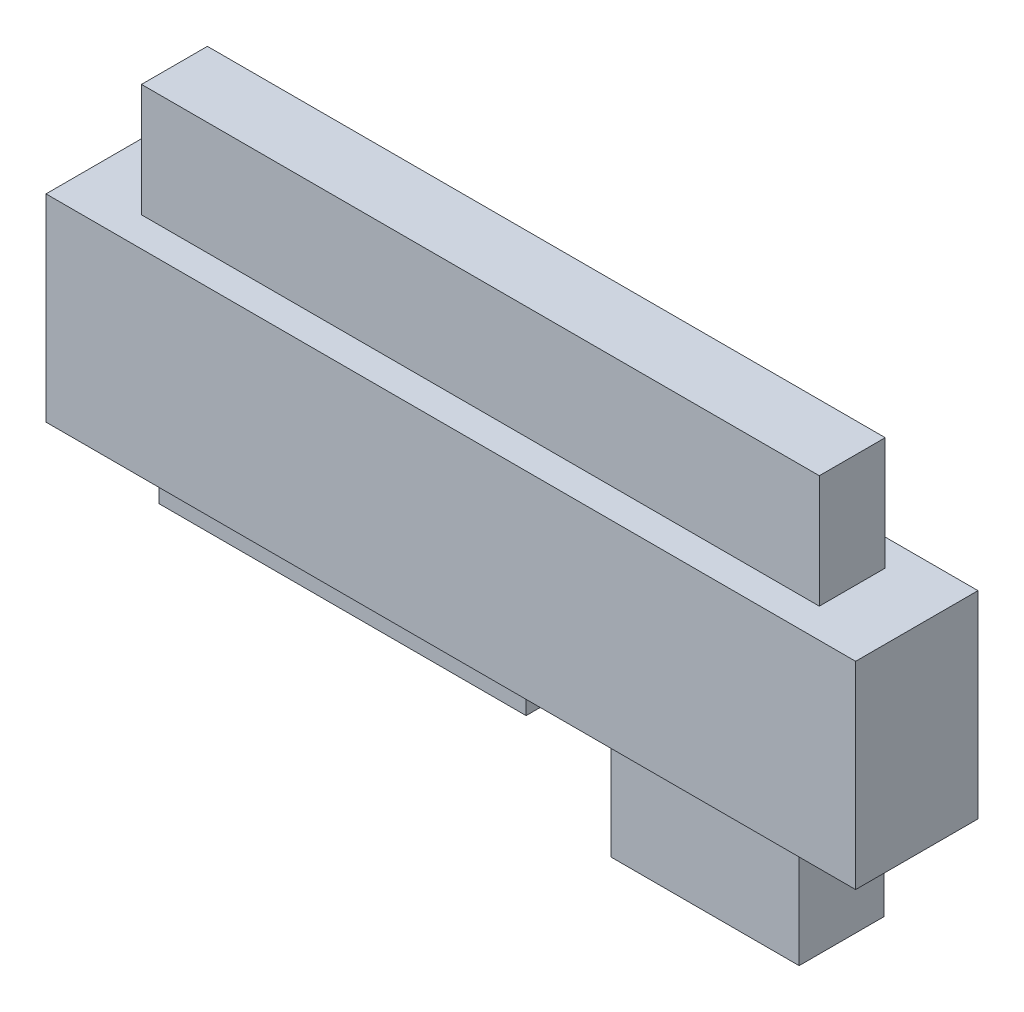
ISO-10303-21;
HEADER;
FILE_DESCRIPTION(('STEP AP214'),'2;1');
FILE_NAME('part.step','',(''),(''),'','','');
FILE_SCHEMA(('AUTOMOTIVE_DESIGN { 1 0 10303 214 1 1 1 1 }'));
ENDSEC;
DATA;
#1=APPLICATION_CONTEXT('core data for automotive mechanical design processes');
#2=APPLICATION_PROTOCOL_DEFINITION('international standard','automotive_design',2000,#1);
#3=PRODUCT_CONTEXT('',#1,'mechanical');
#4=PRODUCT('Part','Part','',(#3));
#5=PRODUCT_RELATED_PRODUCT_CATEGORY('part','',(#4));
#6=PRODUCT_DEFINITION_FORMATION('','',#4);
#7=PRODUCT_DEFINITION_CONTEXT('part definition',#1,'design');
#8=PRODUCT_DEFINITION('design','',#6,#7);
#9=PRODUCT_DEFINITION_SHAPE('','',#8);
#10=(LENGTH_UNIT() NAMED_UNIT(*) SI_UNIT(.MILLI.,.METRE.));
#11=(NAMED_UNIT(*) PLANE_ANGLE_UNIT() SI_UNIT($,.RADIAN.));
#12=(NAMED_UNIT(*) SI_UNIT($,.STERADIAN.) SOLID_ANGLE_UNIT());
#13=UNCERTAINTY_MEASURE_WITH_UNIT(LENGTH_MEASURE(1.E-05),#10,'distance_accuracy_value','');
#14=(GEOMETRIC_REPRESENTATION_CONTEXT(3) GLOBAL_UNCERTAINTY_ASSIGNED_CONTEXT((#13)) GLOBAL_UNIT_ASSIGNED_CONTEXT((#10,
#11,#12)) REPRESENTATION_CONTEXT('',''));
#15=CARTESIAN_POINT('',(0.,0.,0.));
#16=DIRECTION('',(0.,0.,1.));
#17=DIRECTION('',(1.,0.,0.));
#18=AXIS2_PLACEMENT_3D('',#15,#16,#17);
#19=CARTESIAN_POINT('',(0.,0.,0.));
#20=DIRECTION('',(0.,-1.,0.));
#21=DIRECTION('',(0.,0.,-1.));
#22=AXIS2_PLACEMENT_3D('',#19,#20,#21);
#23=PLANE('',#22);
#24=DIRECTION('',(-1.,0.,0.));
#25=VECTOR('',#24,1.);
#26=CARTESIAN_POINT('',(7.50000000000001,0.,2.25));
#27=LINE('',#26,#25);
#28=CARTESIAN_POINT('',(17.5,0.,2.25));
#29=VERTEX_POINT('',#28);
#30=CARTESIAN_POINT('',(7.50000000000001,0.,2.25));
#31=VERTEX_POINT('',#30);
#32=EDGE_CURVE('E190',#29,#31,#27,.T.);
#33=ORIENTED_EDGE('',*,*,#32,.F.);
#34=DIRECTION('',(0.,0.,1.));
#35=VECTOR('',#34,1.);
#36=CARTESIAN_POINT('',(17.5,0.,-2.25));
#37=LINE('',#36,#35);
#38=CARTESIAN_POINT('',(17.5,0.,-2.25));
#39=VERTEX_POINT('',#38);
#40=EDGE_CURVE('E169',#39,#29,#37,.T.);
#41=ORIENTED_EDGE('',*,*,#40,.F.);
#42=DIRECTION('',(1.,0.,0.));
#43=VECTOR('',#42,1.);
#44=CARTESIAN_POINT('',(7.50000000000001,0.,-2.25));
#45=LINE('',#44,#43);
#46=CARTESIAN_POINT('',(7.50000000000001,0.,-2.25));
#47=VERTEX_POINT('',#46);
#48=EDGE_CURVE('E183',#47,#39,#45,.T.);
#49=ORIENTED_EDGE('',*,*,#48,.F.);
#50=DIRECTION('',(0.,0.,-1.));
#51=VECTOR('',#50,1.);
#52=CARTESIAN_POINT('',(7.50000000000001,0.,-2.25));
#53=LINE('',#52,#51);
#54=EDGE_CURVE('E57',#31,#47,#53,.T.);
#55=ORIENTED_EDGE('',*,*,#54,.F.);
#56=EDGE_LOOP('',(#33,#41,#49,#55));
#57=FACE_BOUND('',#56,.T.);
#58=DIRECTION('',(0.,0.,-1.));
#59=VECTOR('',#58,1.);
#60=CARTESIAN_POINT('',(21.5,0.,3.25));
#61=LINE('',#60,#59);
#62=CARTESIAN_POINT('',(21.5,0.,3.25));
#63=VERTEX_POINT('',#62);
#64=CARTESIAN_POINT('',(21.5,0.,-3.25));
#65=VERTEX_POINT('',#64);
#66=EDGE_CURVE('E221',#63,#65,#61,.T.);
#67=ORIENTED_EDGE('',*,*,#66,.F.);
#68=DIRECTION('',(1.,0.,0.));
#69=VECTOR('',#68,1.);
#70=CARTESIAN_POINT('',(-21.5,0.,3.25));
#71=LINE('',#70,#69);
#72=CARTESIAN_POINT('',(-21.5,0.,3.25));
#73=VERTEX_POINT('',#72);
#74=EDGE_CURVE('E251',#73,#63,#71,.T.);
#75=ORIENTED_EDGE('',*,*,#74,.F.);
#76=DIRECTION('',(0.,0.,1.));
#77=VECTOR('',#76,1.);
#78=CARTESIAN_POINT('',(-21.5,0.,3.25));
#79=LINE('',#78,#77);
#80=CARTESIAN_POINT('',(-21.5,0.,-3.25));
#81=VERTEX_POINT('',#80);
#82=EDGE_CURVE('E262',#81,#73,#79,.T.);
#83=ORIENTED_EDGE('',*,*,#82,.F.);
#84=DIRECTION('',(-1.,0.,0.));
#85=VECTOR('',#84,1.);
#86=CARTESIAN_POINT('',(-21.5,0.,-3.25));
#87=LINE('',#86,#85);
#88=EDGE_CURVE('E260',#65,#81,#87,.T.);
#89=ORIENTED_EDGE('',*,*,#88,.F.);
#90=EDGE_LOOP('',(#67,#75,#83,#89));
#91=FACE_BOUND('',#90,.T.);
#92=DIRECTION('',(-1.,0.,0.));
#93=VECTOR('',#92,1.);
#94=CARTESIAN_POINT('',(-16.75,0.,2.));
#95=LINE('',#94,#93);
#96=CARTESIAN_POINT('',(2.75000000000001,0.,2.));
#97=VERTEX_POINT('',#96);
#98=CARTESIAN_POINT('',(-16.75,0.,2.));
#99=VERTEX_POINT('',#98);
#100=EDGE_CURVE('E179',#97,#99,#95,.T.);
#101=ORIENTED_EDGE('',*,*,#100,.F.);
#102=DIRECTION('',(0.,0.,1.));
#103=VECTOR('',#102,1.);
#104=CARTESIAN_POINT('',(2.75000000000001,0.,-2.));
#105=LINE('',#104,#103);
#106=CARTESIAN_POINT('',(2.75000000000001,0.,-2.));
#107=VERTEX_POINT('',#106);
#108=EDGE_CURVE('E173',#107,#97,#105,.T.);
#109=ORIENTED_EDGE('',*,*,#108,.F.);
#110=DIRECTION('',(1.,0.,0.));
#111=VECTOR('',#110,1.);
#112=CARTESIAN_POINT('',(-16.75,0.,-2.));
#113=LINE('',#112,#111);
#114=CARTESIAN_POINT('',(-16.75,0.,-2.));
#115=VERTEX_POINT('',#114);
#116=EDGE_CURVE('E153',#115,#107,#113,.T.);
#117=ORIENTED_EDGE('',*,*,#116,.F.);
#118=DIRECTION('',(0.,0.,-1.));
#119=VECTOR('',#118,1.);
#120=CARTESIAN_POINT('',(-16.75,0.,-2.));
#121=LINE('',#120,#119);
#122=EDGE_CURVE('E49',#99,#115,#121,.T.);
#123=ORIENTED_EDGE('',*,*,#122,.F.);
#124=EDGE_LOOP('',(#101,#109,#117,#123));
#125=FACE_BOUND('',#124,.T.);
#126=ADVANCED_FACE('F34',(#57,#91,#125),#23,.T.);
#127=CARTESIAN_POINT('',(0.,10.5,0.));
#128=DIRECTION('',(0.,-1.,0.));
#129=DIRECTION('',(0.,0.,-1.));
#130=AXIS2_PLACEMENT_3D('',#127,#128,#129);
#131=PLANE('',#130);
#132=DIRECTION('',(0.,0.,-1.));
#133=VECTOR('',#132,1.);
#134=CARTESIAN_POINT('',(21.5,10.5,3.25));
#135=LINE('',#134,#133);
#136=CARTESIAN_POINT('',(21.5,10.5,3.25));
#137=VERTEX_POINT('',#136);
#138=CARTESIAN_POINT('',(21.5,10.5,-3.25));
#139=VERTEX_POINT('',#138);
#140=EDGE_CURVE('E247',#137,#139,#135,.T.);
#141=ORIENTED_EDGE('',*,*,#140,.T.);
#142=DIRECTION('',(-1.,0.,0.));
#143=VECTOR('',#142,1.);
#144=CARTESIAN_POINT('',(-21.5,10.5,-3.25));
#145=LINE('',#144,#143);
#146=CARTESIAN_POINT('',(-21.5,10.5,-3.25));
#147=VERTEX_POINT('',#146);
#148=EDGE_CURVE('E250',#139,#147,#145,.T.);
#149=ORIENTED_EDGE('',*,*,#148,.T.);
#150=DIRECTION('',(0.,0.,1.));
#151=VECTOR('',#150,1.);
#152=CARTESIAN_POINT('',(-21.5,10.5,3.25));
#153=LINE('',#152,#151);
#154=CARTESIAN_POINT('',(-21.5,10.5,3.25));
#155=VERTEX_POINT('',#154);
#156=EDGE_CURVE('E253',#147,#155,#153,.T.);
#157=ORIENTED_EDGE('',*,*,#156,.T.);
#158=DIRECTION('',(1.,0.,0.));
#159=VECTOR('',#158,1.);
#160=CARTESIAN_POINT('',(-21.5,10.5,3.25));
#161=LINE('',#160,#159);
#162=EDGE_CURVE('E255',#155,#137,#161,.T.);
#163=ORIENTED_EDGE('',*,*,#162,.T.);
#164=EDGE_LOOP('',(#141,#149,#157,#163));
#165=FACE_BOUND('',#164,.T.);
#166=DIRECTION('',(1.,0.,0.));
#167=VECTOR('',#166,1.);
#168=CARTESIAN_POINT('',(-18.,10.5,1.67788848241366));
#169=LINE('',#168,#167);
#170=CARTESIAN_POINT('',(-18.,10.5,1.67788848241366));
#171=VERTEX_POINT('',#170);
#172=CARTESIAN_POINT('',(18.,10.5,1.67788848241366));
#173=VERTEX_POINT('',#172);
#174=EDGE_CURVE('E230',#171,#173,#169,.T.);
#175=ORIENTED_EDGE('',*,*,#174,.F.);
#176=DIRECTION('',(0.,0.,1.));
#177=VECTOR('',#176,1.);
#178=CARTESIAN_POINT('',(-18.,10.5,1.67788848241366));
#179=LINE('',#178,#177);
#180=CARTESIAN_POINT('',(-18.,10.5,-1.82211151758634));
#181=VERTEX_POINT('',#180);
#182=EDGE_CURVE('E227',#181,#171,#179,.T.);
#183=ORIENTED_EDGE('',*,*,#182,.F.);
#184=DIRECTION('',(-1.,0.,0.));
#185=VECTOR('',#184,1.);
#186=CARTESIAN_POINT('',(-18.,10.5,-1.82211151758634));
#187=LINE('',#186,#185);
#188=CARTESIAN_POINT('',(18.,10.5,-1.82211151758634));
#189=VERTEX_POINT('',#188);
#190=EDGE_CURVE('E224',#189,#181,#187,.T.);
#191=ORIENTED_EDGE('',*,*,#190,.F.);
#192=DIRECTION('',(0.,0.,-1.));
#193=VECTOR('',#192,1.);
#194=CARTESIAN_POINT('',(18.,10.5,1.67788848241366));
#195=LINE('',#194,#193);
#196=EDGE_CURVE('E199',#173,#189,#195,.T.);
#197=ORIENTED_EDGE('',*,*,#196,.F.);
#198=EDGE_LOOP('',(#175,#183,#191,#197));
#199=FACE_BOUND('',#198,.T.);
#200=ADVANCED_FACE('F289',(#165,#199),#131,.F.);
#201=CARTESIAN_POINT('',(21.5,10.5,3.25));
#202=DIRECTION('',(-1.,0.,0.));
#203=DIRECTION('',(0.,0.,1.));
#204=AXIS2_PLACEMENT_3D('',#201,#202,#203);
#205=PLANE('',#204);
#206=ORIENTED_EDGE('',*,*,#66,.T.);
#207=DIRECTION('',(0.,-1.,0.));
#208=VECTOR('',#207,1.);
#209=CARTESIAN_POINT('',(21.5,10.5,-3.25));
#210=LINE('',#209,#208);
#211=EDGE_CURVE('E12',#139,#65,#210,.T.);
#212=ORIENTED_EDGE('',*,*,#211,.F.);
#213=ORIENTED_EDGE('',*,*,#140,.F.);
#214=DIRECTION('',(0.,-1.,0.));
#215=VECTOR('',#214,1.);
#216=CARTESIAN_POINT('',(21.5,10.5,3.25));
#217=LINE('',#216,#215);
#218=EDGE_CURVE('E257',#137,#63,#217,.T.);
#219=ORIENTED_EDGE('',*,*,#218,.T.);
#220=EDGE_LOOP('',(#206,#212,#213,#219));
#221=FACE_BOUND('',#220,.T.);
#222=ADVANCED_FACE('F36',(#221),#205,.F.);
#223=CARTESIAN_POINT('',(-21.5,10.5,-3.25));
#224=DIRECTION('',(0.,0.,1.));
#225=DIRECTION('',(1.,0.,0.));
#226=AXIS2_PLACEMENT_3D('',#223,#224,#225);
#227=PLANE('',#226);
#228=ORIENTED_EDGE('',*,*,#88,.T.);
#229=DIRECTION('',(0.,-1.,0.));
#230=VECTOR('',#229,1.);
#231=CARTESIAN_POINT('',(-21.5,10.5,-3.25));
#232=LINE('',#231,#230);
#233=EDGE_CURVE('E42',#147,#81,#232,.T.);
#234=ORIENTED_EDGE('',*,*,#233,.F.);
#235=ORIENTED_EDGE('',*,*,#148,.F.);
#236=ORIENTED_EDGE('',*,*,#211,.T.);
#237=EDGE_LOOP('',(#228,#234,#235,#236));
#238=FACE_BOUND('',#237,.T.);
#239=ADVANCED_FACE('F291',(#238),#227,.F.);
#240=CARTESIAN_POINT('',(-21.5,10.5,3.25));
#241=DIRECTION('',(1.,0.,0.));
#242=DIRECTION('',(0.,0.,-1.));
#243=AXIS2_PLACEMENT_3D('',#240,#241,#242);
#244=PLANE('',#243);
#245=ORIENTED_EDGE('',*,*,#82,.T.);
#246=DIRECTION('',(0.,-1.,0.));
#247=VECTOR('',#246,1.);
#248=CARTESIAN_POINT('',(-21.5,10.5,3.25));
#249=LINE('',#248,#247);
#250=EDGE_CURVE('E267',#155,#73,#249,.T.);
#251=ORIENTED_EDGE('',*,*,#250,.F.);
#252=ORIENTED_EDGE('',*,*,#156,.F.);
#253=ORIENTED_EDGE('',*,*,#233,.T.);
#254=EDGE_LOOP('',(#245,#251,#252,#253));
#255=FACE_BOUND('',#254,.T.);
#256=ADVANCED_FACE('F274',(#255),#244,.F.);
#257=CARTESIAN_POINT('',(-21.5,10.5,3.25));
#258=DIRECTION('',(0.,0.,-1.));
#259=DIRECTION('',(-1.,0.,0.));
#260=AXIS2_PLACEMENT_3D('',#257,#258,#259);
#261=PLANE('',#260);
#262=ORIENTED_EDGE('',*,*,#74,.T.);
#263=ORIENTED_EDGE('',*,*,#218,.F.);
#264=ORIENTED_EDGE('',*,*,#162,.F.);
#265=ORIENTED_EDGE('',*,*,#250,.T.);
#266=EDGE_LOOP('',(#262,#263,#264,#265));
#267=FACE_BOUND('',#266,.T.);
#268=ADVANCED_FACE('F283',(#267),#261,.F.);
#269=CARTESIAN_POINT('',(-18.,69.1697387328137,1.67788848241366));
#270=DIRECTION('',(0.,0.,-1.));
#271=DIRECTION('',(-1.,0.,0.));
#272=AXIS2_PLACEMENT_3D('',#269,#270,#271);
#273=PLANE('',#272);
#274=DIRECTION('',(0.,-1.,0.));
#275=VECTOR('',#274,1.);
#276=CARTESIAN_POINT('',(18.,69.1697387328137,1.67788848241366));
#277=LINE('',#276,#275);
#278=CARTESIAN_POINT('',(18.,16.5,1.67788848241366));
#279=VERTEX_POINT('',#278);
#280=EDGE_CURVE('E233',#279,#173,#277,.T.);
#281=ORIENTED_EDGE('',*,*,#280,.F.);
#282=DIRECTION('',(-1.,0.,0.));
#283=VECTOR('',#282,1.);
#284=CARTESIAN_POINT('',(-18.,16.5,1.67788848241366));
#285=LINE('',#284,#283);
#286=CARTESIAN_POINT('',(-18.,16.5,1.67788848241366));
#287=VERTEX_POINT('',#286);
#288=EDGE_CURVE('E215',#279,#287,#285,.T.);
#289=ORIENTED_EDGE('',*,*,#288,.T.);
#290=DIRECTION('',(0.,-1.,0.));
#291=VECTOR('',#290,1.);
#292=CARTESIAN_POINT('',(-18.,69.1697387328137,1.67788848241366));
#293=LINE('',#292,#291);
#294=EDGE_CURVE('E236',#287,#171,#293,.T.);
#295=ORIENTED_EDGE('',*,*,#294,.T.);
#296=ORIENTED_EDGE('',*,*,#174,.T.);
#297=EDGE_LOOP('',(#281,#289,#295,#296));
#298=FACE_BOUND('',#297,.T.);
#299=ADVANCED_FACE('F309',(#298),#273,.F.);
#300=CARTESIAN_POINT('',(-18.,69.1697387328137,1.67788848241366));
#301=DIRECTION('',(1.,0.,0.));
#302=DIRECTION('',(0.,0.,-1.));
#303=AXIS2_PLACEMENT_3D('',#300,#301,#302);
#304=PLANE('',#303);
#305=ORIENTED_EDGE('',*,*,#294,.F.);
#306=DIRECTION('',(0.,0.,-1.));
#307=VECTOR('',#306,1.);
#308=CARTESIAN_POINT('',(-18.,16.5,1.67788848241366));
#309=LINE('',#308,#307);
#310=CARTESIAN_POINT('',(-18.,16.5,-1.82211151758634));
#311=VERTEX_POINT('',#310);
#312=EDGE_CURVE('E211',#287,#311,#309,.T.);
#313=ORIENTED_EDGE('',*,*,#312,.T.);
#314=DIRECTION('',(0.,-1.,0.));
#315=VECTOR('',#314,1.);
#316=CARTESIAN_POINT('',(-18.,69.1697387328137,-1.82211151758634));
#317=LINE('',#316,#315);
#318=EDGE_CURVE('E239',#311,#181,#317,.T.);
#319=ORIENTED_EDGE('',*,*,#318,.T.);
#320=ORIENTED_EDGE('',*,*,#182,.T.);
#321=EDGE_LOOP('',(#305,#313,#319,#320));
#322=FACE_BOUND('',#321,.T.);
#323=ADVANCED_FACE('F313',(#322),#304,.F.);
#324=CARTESIAN_POINT('',(-18.,69.1697387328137,-1.82211151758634));
#325=DIRECTION('',(0.,0.,1.));
#326=DIRECTION('',(1.,0.,0.));
#327=AXIS2_PLACEMENT_3D('',#324,#325,#326);
#328=PLANE('',#327);
#329=ORIENTED_EDGE('',*,*,#318,.F.);
#330=DIRECTION('',(1.,0.,0.));
#331=VECTOR('',#330,1.);
#332=CARTESIAN_POINT('',(-18.,16.5,-1.82211151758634));
#333=LINE('',#332,#331);
#334=CARTESIAN_POINT('',(18.,16.5,-1.82211151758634));
#335=VERTEX_POINT('',#334);
#336=EDGE_CURVE('E214',#311,#335,#333,.T.);
#337=ORIENTED_EDGE('',*,*,#336,.T.);
#338=DIRECTION('',(0.,-1.,0.));
#339=VECTOR('',#338,1.);
#340=CARTESIAN_POINT('',(18.,69.1697387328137,-1.82211151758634));
#341=LINE('',#340,#339);
#342=EDGE_CURVE('E242',#335,#189,#341,.T.);
#343=ORIENTED_EDGE('',*,*,#342,.T.);
#344=ORIENTED_EDGE('',*,*,#190,.T.);
#345=EDGE_LOOP('',(#329,#337,#343,#344));
#346=FACE_BOUND('',#345,.T.);
#347=ADVANCED_FACE('F319',(#346),#328,.F.);
#348=CARTESIAN_POINT('',(18.,69.1697387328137,1.67788848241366));
#349=DIRECTION('',(-1.,0.,0.));
#350=DIRECTION('',(0.,0.,1.));
#351=AXIS2_PLACEMENT_3D('',#348,#349,#350);
#352=PLANE('',#351);
#353=ORIENTED_EDGE('',*,*,#342,.F.);
#354=DIRECTION('',(0.,0.,1.));
#355=VECTOR('',#354,1.);
#356=CARTESIAN_POINT('',(18.,16.5,1.67788848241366));
#357=LINE('',#356,#355);
#358=EDGE_CURVE('E218',#335,#279,#357,.T.);
#359=ORIENTED_EDGE('',*,*,#358,.T.);
#360=ORIENTED_EDGE('',*,*,#280,.T.);
#361=ORIENTED_EDGE('',*,*,#196,.T.);
#362=EDGE_LOOP('',(#353,#359,#360,#361));
#363=FACE_BOUND('',#362,.T.);
#364=ADVANCED_FACE('F328',(#363),#352,.F.);
#365=CARTESIAN_POINT('',(0.,16.5,0.));
#366=DIRECTION('',(0.,-1.,0.));
#367=DIRECTION('',(0.,0.,-1.));
#368=AXIS2_PLACEMENT_3D('',#365,#366,#367);
#369=PLANE('',#368);
#370=ORIENTED_EDGE('',*,*,#336,.F.);
#371=ORIENTED_EDGE('',*,*,#312,.F.);
#372=ORIENTED_EDGE('',*,*,#288,.F.);
#373=ORIENTED_EDGE('',*,*,#358,.F.);
#374=EDGE_LOOP('',(#370,#371,#372,#373));
#375=FACE_BOUND('',#374,.T.);
#376=ADVANCED_FACE('F324',(#375),#369,.F.);
#377=CARTESIAN_POINT('',(17.5,-33.4658560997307,-2.25));
#378=DIRECTION('',(-1.,0.,0.));
#379=DIRECTION('',(0.,0.,1.));
#380=AXIS2_PLACEMENT_3D('',#377,#378,#379);
#381=PLANE('',#380);
#382=DIRECTION('',(0.,0.,1.));
#383=VECTOR('',#382,1.);
#384=CARTESIAN_POINT('',(17.5,-6.,-2.25));
#385=LINE('',#384,#383);
#386=CARTESIAN_POINT('',(17.5,-6.,-2.25));
#387=VERTEX_POINT('',#386);
#388=CARTESIAN_POINT('',(17.5,-6.,2.25));
#389=VERTEX_POINT('',#388);
#390=EDGE_CURVE('E203',#387,#389,#385,.T.);
#391=ORIENTED_EDGE('',*,*,#390,.F.);
#392=DIRECTION('',(0.,1.,0.));
#393=VECTOR('',#392,1.);
#394=CARTESIAN_POINT('',(17.5,-33.4658560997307,-2.25));
#395=LINE('',#394,#393);
#396=EDGE_CURVE('E167',#387,#39,#395,.T.);
#397=ORIENTED_EDGE('',*,*,#396,.T.);
#398=ORIENTED_EDGE('',*,*,#40,.T.);
#399=DIRECTION('',(0.,1.,0.));
#400=VECTOR('',#399,1.);
#401=CARTESIAN_POINT('',(17.5,-33.4658560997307,2.25));
#402=LINE('',#401,#400);
#403=EDGE_CURVE('E193',#389,#29,#402,.T.);
#404=ORIENTED_EDGE('',*,*,#403,.F.);
#405=EDGE_LOOP('',(#391,#397,#398,#404));
#406=FACE_BOUND('',#405,.T.);
#407=ADVANCED_FACE('F335',(#406),#381,.F.);
#408=CARTESIAN_POINT('',(7.50000000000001,-33.4658560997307,2.25));
#409=DIRECTION('',(0.,0.,-1.));
#410=DIRECTION('',(-1.,0.,0.));
#411=AXIS2_PLACEMENT_3D('',#408,#409,#410);
#412=PLANE('',#411);
#413=DIRECTION('',(-1.,0.,0.));
#414=VECTOR('',#413,1.);
#415=CARTESIAN_POINT('',(7.50000000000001,-6.,2.25));
#416=LINE('',#415,#414);
#417=CARTESIAN_POINT('',(7.50000000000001,-6.,2.25));
#418=VERTEX_POINT('',#417);
#419=EDGE_CURVE('E200',#389,#418,#416,.T.);
#420=ORIENTED_EDGE('',*,*,#419,.F.);
#421=ORIENTED_EDGE('',*,*,#403,.T.);
#422=ORIENTED_EDGE('',*,*,#32,.T.);
#423=DIRECTION('',(0.,1.,0.));
#424=VECTOR('',#423,1.);
#425=CARTESIAN_POINT('',(7.50000000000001,-33.4658560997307,2.25));
#426=LINE('',#425,#424);
#427=EDGE_CURVE('E189',#418,#31,#426,.T.);
#428=ORIENTED_EDGE('',*,*,#427,.F.);
#429=EDGE_LOOP('',(#420,#421,#422,#428));
#430=FACE_BOUND('',#429,.T.);
#431=ADVANCED_FACE('F343',(#430),#412,.F.);
#432=CARTESIAN_POINT('',(7.50000000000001,-33.4658560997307,-2.25));
#433=DIRECTION('',(1.,0.,0.));
#434=DIRECTION('',(0.,0.,-1.));
#435=AXIS2_PLACEMENT_3D('',#432,#433,#434);
#436=PLANE('',#435);
#437=DIRECTION('',(0.,0.,-1.));
#438=VECTOR('',#437,1.);
#439=CARTESIAN_POINT('',(7.50000000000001,-6.,-2.25));
#440=LINE('',#439,#438);
#441=CARTESIAN_POINT('',(7.50000000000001,-6.,-2.25));
#442=VERTEX_POINT('',#441);
#443=EDGE_CURVE('E196',#418,#442,#440,.T.);
#444=ORIENTED_EDGE('',*,*,#443,.F.);
#445=ORIENTED_EDGE('',*,*,#427,.T.);
#446=ORIENTED_EDGE('',*,*,#54,.T.);
#447=DIRECTION('',(0.,1.,0.));
#448=VECTOR('',#447,1.);
#449=CARTESIAN_POINT('',(7.50000000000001,-33.4658560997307,-2.25));
#450=LINE('',#449,#448);
#451=EDGE_CURVE('E187',#442,#47,#450,.T.);
#452=ORIENTED_EDGE('',*,*,#451,.F.);
#453=EDGE_LOOP('',(#444,#445,#446,#452));
#454=FACE_BOUND('',#453,.T.);
#455=ADVANCED_FACE('F349',(#454),#436,.F.);
#456=CARTESIAN_POINT('',(7.50000000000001,-33.4658560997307,-2.25));
#457=DIRECTION('',(0.,0.,1.));
#458=DIRECTION('',(1.,0.,0.));
#459=AXIS2_PLACEMENT_3D('',#456,#457,#458);
#460=PLANE('',#459);
#461=DIRECTION('',(1.,0.,0.));
#462=VECTOR('',#461,1.);
#463=CARTESIAN_POINT('',(7.50000000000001,-6.,-2.25));
#464=LINE('',#463,#462);
#465=EDGE_CURVE('E186',#442,#387,#464,.T.);
#466=ORIENTED_EDGE('',*,*,#465,.F.);
#467=ORIENTED_EDGE('',*,*,#451,.T.);
#468=ORIENTED_EDGE('',*,*,#48,.T.);
#469=ORIENTED_EDGE('',*,*,#396,.F.);
#470=EDGE_LOOP('',(#466,#467,#468,#469));
#471=FACE_BOUND('',#470,.T.);
#472=ADVANCED_FACE('F357',(#471),#460,.F.);
#473=CARTESIAN_POINT('',(0.,-6.,0.));
#474=DIRECTION('',(0.,-1.,0.));
#475=DIRECTION('',(0.,0.,-1.));
#476=AXIS2_PLACEMENT_3D('',#473,#474,#475);
#477=PLANE('',#476);
#478=ORIENTED_EDGE('',*,*,#465,.T.);
#479=ORIENTED_EDGE('',*,*,#390,.T.);
#480=ORIENTED_EDGE('',*,*,#419,.T.);
#481=ORIENTED_EDGE('',*,*,#443,.T.);
#482=EDGE_LOOP('',(#478,#479,#480,#481));
#483=FACE_BOUND('',#482,.T.);
#484=ADVANCED_FACE('F354',(#483),#477,.T.);
#485=CARTESIAN_POINT('',(2.75000000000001,-34.4060292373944,-2.));
#486=DIRECTION('',(-1.,0.,0.));
#487=DIRECTION('',(0.,0.,1.));
#488=AXIS2_PLACEMENT_3D('',#485,#486,#487);
#489=PLANE('',#488);
#490=DIRECTION('',(0.,0.,1.));
#491=VECTOR('',#490,1.);
#492=CARTESIAN_POINT('',(2.75000000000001,-2.,-2.));
#493=LINE('',#492,#491);
#494=CARTESIAN_POINT('',(2.75000000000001,-2.,-2.));
#495=VERTEX_POINT('',#494);
#496=CARTESIAN_POINT('',(2.75000000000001,-2.,2.));
#497=VERTEX_POINT('',#496);
#498=EDGE_CURVE('E162',#495,#497,#493,.T.);
#499=ORIENTED_EDGE('',*,*,#498,.F.);
#500=DIRECTION('',(0.,1.,0.));
#501=VECTOR('',#500,1.);
#502=CARTESIAN_POINT('',(2.75000000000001,-34.4060292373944,-2.));
#503=LINE('',#502,#501);
#504=EDGE_CURVE('E158',#495,#107,#503,.T.);
#505=ORIENTED_EDGE('',*,*,#504,.T.);
#506=ORIENTED_EDGE('',*,*,#108,.T.);
#507=DIRECTION('',(0.,1.,0.));
#508=VECTOR('',#507,1.);
#509=CARTESIAN_POINT('',(2.75000000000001,-34.4060292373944,2.));
#510=LINE('',#509,#508);
#511=EDGE_CURVE('E177',#497,#97,#510,.T.);
#512=ORIENTED_EDGE('',*,*,#511,.F.);
#513=EDGE_LOOP('',(#499,#505,#506,#512));
#514=FACE_BOUND('',#513,.T.);
#515=ADVANCED_FACE('F356',(#514),#489,.F.);
#516=CARTESIAN_POINT('',(-16.75,-34.4060292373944,2.));
#517=DIRECTION('',(0.,0.,-1.));
#518=DIRECTION('',(-1.,0.,0.));
#519=AXIS2_PLACEMENT_3D('',#516,#517,#518);
#520=PLANE('',#519);
#521=DIRECTION('',(-1.,0.,0.));
#522=VECTOR('',#521,1.);
#523=CARTESIAN_POINT('',(-16.75,-2.,2.));
#524=LINE('',#523,#522);
#525=CARTESIAN_POINT('',(-16.75,-2.,2.));
#526=VERTEX_POINT('',#525);
#527=EDGE_CURVE('E166',#497,#526,#524,.T.);
#528=ORIENTED_EDGE('',*,*,#527,.F.);
#529=ORIENTED_EDGE('',*,*,#511,.T.);
#530=ORIENTED_EDGE('',*,*,#100,.T.);
#531=DIRECTION('',(0.,1.,0.));
#532=VECTOR('',#531,1.);
#533=CARTESIAN_POINT('',(-16.75,-34.4060292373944,2.));
#534=LINE('',#533,#532);
#535=EDGE_CURVE('E180',#526,#99,#534,.T.);
#536=ORIENTED_EDGE('',*,*,#535,.F.);
#537=EDGE_LOOP('',(#528,#529,#530,#536));
#538=FACE_BOUND('',#537,.T.);
#539=ADVANCED_FACE('F363',(#538),#520,.F.);
#540=CARTESIAN_POINT('',(-16.75,-34.4060292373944,-2.));
#541=DIRECTION('',(1.,0.,0.));
#542=DIRECTION('',(0.,0.,-1.));
#543=AXIS2_PLACEMENT_3D('',#540,#541,#542);
#544=PLANE('',#543);
#545=DIRECTION('',(0.,0.,-1.));
#546=VECTOR('',#545,1.);
#547=CARTESIAN_POINT('',(-16.75,-2.,-2.));
#548=LINE('',#547,#546);
#549=CARTESIAN_POINT('',(-16.75,-2.,-2.));
#550=VERTEX_POINT('',#549);
#551=EDGE_CURVE('E148',#526,#550,#548,.T.);
#552=ORIENTED_EDGE('',*,*,#551,.F.);
#553=ORIENTED_EDGE('',*,*,#535,.T.);
#554=ORIENTED_EDGE('',*,*,#122,.T.);
#555=DIRECTION('',(0.,1.,0.));
#556=VECTOR('',#555,1.);
#557=CARTESIAN_POINT('',(-16.75,-34.4060292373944,-2.));
#558=LINE('',#557,#556);
#559=EDGE_CURVE('E144',#550,#115,#558,.T.);
#560=ORIENTED_EDGE('',*,*,#559,.F.);
#561=EDGE_LOOP('',(#552,#553,#554,#560));
#562=FACE_BOUND('',#561,.T.);
#563=ADVANCED_FACE('F146',(#562),#544,.F.);
#564=CARTESIAN_POINT('',(-16.75,-34.4060292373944,-2.));
#565=DIRECTION('',(0.,0.,1.));
#566=DIRECTION('',(1.,0.,0.));
#567=AXIS2_PLACEMENT_3D('',#564,#565,#566);
#568=PLANE('',#567);
#569=DIRECTION('',(1.,0.,0.));
#570=VECTOR('',#569,1.);
#571=CARTESIAN_POINT('',(-16.75,-2.,-2.));
#572=LINE('',#571,#570);
#573=EDGE_CURVE('E156',#550,#495,#572,.T.);
#574=ORIENTED_EDGE('',*,*,#573,.F.);
#575=ORIENTED_EDGE('',*,*,#559,.T.);
#576=ORIENTED_EDGE('',*,*,#116,.T.);
#577=ORIENTED_EDGE('',*,*,#504,.F.);
#578=EDGE_LOOP('',(#574,#575,#576,#577));
#579=FACE_BOUND('',#578,.T.);
#580=ADVANCED_FACE('F157',(#579),#568,.F.);
#581=CARTESIAN_POINT('',(0.,-2.,0.));
#582=DIRECTION('',(0.,-1.,0.));
#583=DIRECTION('',(0.,0.,-1.));
#584=AXIS2_PLACEMENT_3D('',#581,#582,#583);
#585=PLANE('',#584);
#586=ORIENTED_EDGE('',*,*,#573,.T.);
#587=ORIENTED_EDGE('',*,*,#498,.T.);
#588=ORIENTED_EDGE('',*,*,#527,.T.);
#589=ORIENTED_EDGE('',*,*,#551,.T.);
#590=EDGE_LOOP('',(#586,#587,#588,#589));
#591=FACE_BOUND('',#590,.T.);
#592=ADVANCED_FACE('F165',(#591),#585,.T.);
#593=CLOSED_SHELL('',(#126,#200,#222,#239,#256,#268,#299,#323,#347,#364,#376,#407,#431,#455,
#472,#484,#515,#539,#563,#580,#592));
#594=MANIFOLD_SOLID_BREP('B2',#593);
#595=ADVANCED_BREP_SHAPE_REPRESENTATION('',(#18,#594),#14);
#596=SHAPE_DEFINITION_REPRESENTATION(#9,#595);
ENDSEC;
END-ISO-10303-21;
